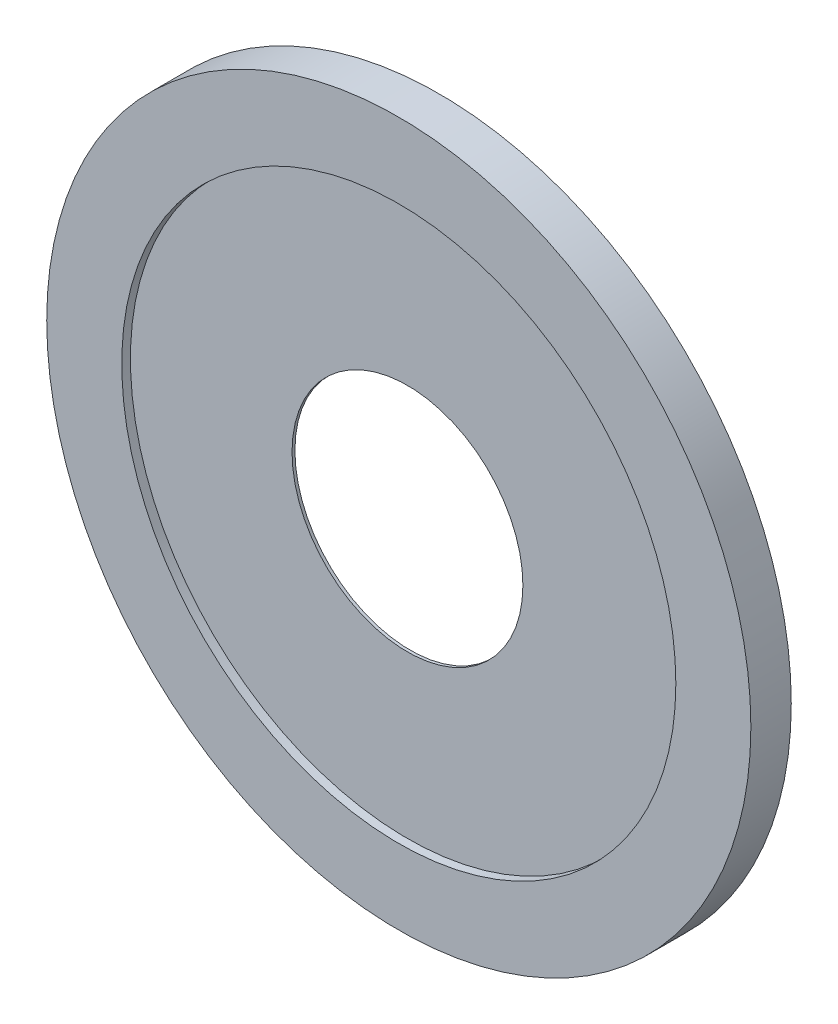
ISO-10303-21;
HEADER;
FILE_DESCRIPTION(('STEP AP214'),'2;1');
FILE_NAME('part.step','',(''),(''),'','','');
FILE_SCHEMA(('AUTOMOTIVE_DESIGN { 1 0 10303 214 1 1 1 1 }'));
ENDSEC;
DATA;
#1=APPLICATION_CONTEXT('core data for automotive mechanical design processes');
#2=APPLICATION_PROTOCOL_DEFINITION('international standard','automotive_design',2000,#1);
#3=PRODUCT_CONTEXT('',#1,'mechanical');
#4=PRODUCT('Part','Part','',(#3));
#5=PRODUCT_RELATED_PRODUCT_CATEGORY('part','',(#4));
#6=PRODUCT_DEFINITION_FORMATION('','',#4);
#7=PRODUCT_DEFINITION_CONTEXT('part definition',#1,'design');
#8=PRODUCT_DEFINITION('design','',#6,#7);
#9=PRODUCT_DEFINITION_SHAPE('','',#8);
#10=(LENGTH_UNIT() NAMED_UNIT(*) SI_UNIT(.MILLI.,.METRE.));
#11=(NAMED_UNIT(*) PLANE_ANGLE_UNIT() SI_UNIT($,.RADIAN.));
#12=(NAMED_UNIT(*) SI_UNIT($,.STERADIAN.) SOLID_ANGLE_UNIT());
#13=UNCERTAINTY_MEASURE_WITH_UNIT(LENGTH_MEASURE(1.E-05),#10,'distance_accuracy_value','');
#14=(GEOMETRIC_REPRESENTATION_CONTEXT(3) GLOBAL_UNCERTAINTY_ASSIGNED_CONTEXT((#13)) GLOBAL_UNIT_ASSIGNED_CONTEXT((#10,
#11,#12)) REPRESENTATION_CONTEXT('',''));
#15=CARTESIAN_POINT('',(0.,0.,0.));
#16=DIRECTION('',(0.,0.,1.));
#17=DIRECTION('',(1.,0.,0.));
#18=AXIS2_PLACEMENT_3D('',#15,#16,#17);
#19=CARTESIAN_POINT('',(0.,0.,44.45));
#20=DIRECTION('',(0.,0.,-1.));
#21=DIRECTION('',(-1.,0.,0.));
#22=AXIS2_PLACEMENT_3D('',#19,#20,#21);
#23=CYLINDRICAL_SURFACE('',#22,387.35);
#24=CARTESIAN_POINT('',(0.,0.,44.45));
#25=DIRECTION('',(0.,0.,1.));
#26=DIRECTION('',(1.,0.,0.));
#27=AXIS2_PLACEMENT_3D('',#24,#25,#26);
#28=CIRCLE('',#27,387.35);
#29=CARTESIAN_POINT('',(387.35,0.,44.45));
#30=VERTEX_POINT('',#29);
#31=EDGE_CURVE('E10',#30,#30,#28,.T.);
#32=ORIENTED_EDGE('',*,*,#31,.F.);
#33=EDGE_LOOP('',(#32));
#34=FACE_BOUND('',#33,.T.);
#35=CARTESIAN_POINT('',(0.,0.,0.));
#36=DIRECTION('',(0.,0.,1.));
#37=DIRECTION('',(1.,0.,0.));
#38=AXIS2_PLACEMENT_3D('',#35,#36,#37);
#39=CIRCLE('',#38,387.35);
#40=CARTESIAN_POINT('',(387.35,0.,0.));
#41=VERTEX_POINT('',#40);
#42=EDGE_CURVE('E36',#41,#41,#39,.T.);
#43=ORIENTED_EDGE('',*,*,#42,.T.);
#44=EDGE_LOOP('',(#43));
#45=FACE_BOUND('',#44,.T.);
#46=ADVANCED_FACE('F33',(#34,#45),#23,.T.);
#47=CARTESIAN_POINT('',(0.,0.,44.45));
#48=DIRECTION('',(0.,0.,1.));
#49=DIRECTION('',(1.,0.,0.));
#50=AXIS2_PLACEMENT_3D('',#47,#48,#49);
#51=PLANE('',#50);
#52=CARTESIAN_POINT('',(0.,0.,44.45));
#53=DIRECTION('',(0.,0.,1.));
#54=DIRECTION('',(1.,0.,0.));
#55=AXIS2_PLACEMENT_3D('',#52,#53,#54);
#56=CIRCLE('',#55,304.8);
#57=CARTESIAN_POINT('',(304.8,0.,44.45));
#58=VERTEX_POINT('',#57);
#59=EDGE_CURVE('E45',#58,#58,#56,.T.);
#60=ORIENTED_EDGE('',*,*,#59,.F.);
#61=EDGE_LOOP('',(#60));
#62=FACE_BOUND('',#61,.T.);
#63=ORIENTED_EDGE('',*,*,#31,.T.);
#64=EDGE_LOOP('',(#63));
#65=FACE_BOUND('',#64,.T.);
#66=ADVANCED_FACE('F79',(#62,#65),#51,.T.);
#67=CARTESIAN_POINT('',(0.,0.,0.));
#68=DIRECTION('',(0.,0.,1.));
#69=DIRECTION('',(1.,0.,0.));
#70=AXIS2_PLACEMENT_3D('',#67,#68,#69);
#71=PLANE('',#70);
#72=CARTESIAN_POINT('',(0.,0.,0.));
#73=DIRECTION('',(0.,0.,-1.));
#74=DIRECTION('',(-1.,0.,0.));
#75=AXIS2_PLACEMENT_3D('',#72,#73,#74);
#76=CIRCLE('',#75,304.8);
#77=CARTESIAN_POINT('',(-304.8,0.,0.));
#78=VERTEX_POINT('',#77);
#79=EDGE_CURVE('E51',#78,#78,#76,.T.);
#80=ORIENTED_EDGE('',*,*,#79,.F.);
#81=EDGE_LOOP('',(#80));
#82=FACE_BOUND('',#81,.T.);
#83=ORIENTED_EDGE('',*,*,#42,.F.);
#84=EDGE_LOOP('',(#83));
#85=FACE_BOUND('',#84,.T.);
#86=ADVANCED_FACE('F75',(#82,#85),#71,.F.);
#87=CARTESIAN_POINT('',(0.,0.,34.925));
#88=DIRECTION('',(0.,0.,1.));
#89=DIRECTION('',(1.,0.,0.));
#90=AXIS2_PLACEMENT_3D('',#87,#88,#89);
#91=CYLINDRICAL_SURFACE('',#90,304.8);
#92=CARTESIAN_POINT('',(0.,0.,34.925));
#93=DIRECTION('',(0.,0.,1.));
#94=DIRECTION('',(1.,0.,0.));
#95=AXIS2_PLACEMENT_3D('',#92,#93,#94);
#96=CIRCLE('',#95,304.8);
#97=CARTESIAN_POINT('',(304.8,0.,34.925));
#98=VERTEX_POINT('',#97);
#99=EDGE_CURVE('E43',#98,#98,#96,.T.);
#100=CARTESIAN_POINT('',(304.8,0.,34.925));
#101=CARTESIAN_POINT('',(304.8,0.,35.02421875));
#102=CARTESIAN_POINT('',(304.8,0.,35.1234375));
#103=CARTESIAN_POINT('',(304.8,0.,35.321875));
#104=CARTESIAN_POINT('',(304.8,0.,35.42109375));
#105=CARTESIAN_POINT('',(304.8,0.,35.61953125));
#106=CARTESIAN_POINT('',(304.8,0.,35.71875));
#107=CARTESIAN_POINT('',(304.8,0.,35.9171875));
#108=CARTESIAN_POINT('',(304.8,0.,36.01640625));
#109=CARTESIAN_POINT('',(304.8,0.,36.21484375));
#110=CARTESIAN_POINT('',(304.8,0.,36.3140625));
#111=CARTESIAN_POINT('',(304.8,0.,36.5125));
#112=CARTESIAN_POINT('',(304.8,0.,36.61171875));
#113=CARTESIAN_POINT('',(304.8,0.,36.81015625));
#114=CARTESIAN_POINT('',(304.8,0.,36.909375));
#115=CARTESIAN_POINT('',(304.8,0.,37.1078125));
#116=CARTESIAN_POINT('',(304.8,0.,37.20703125));
#117=CARTESIAN_POINT('',(304.8,0.,37.40546875));
#118=CARTESIAN_POINT('',(304.8,0.,37.5046875));
#119=CARTESIAN_POINT('',(304.8,0.,37.703125));
#120=CARTESIAN_POINT('',(304.8,0.,37.80234375));
#121=CARTESIAN_POINT('',(304.8,0.,38.00078125));
#122=CARTESIAN_POINT('',(304.8,0.,38.1));
#123=CARTESIAN_POINT('',(304.8,0.,38.2984375));
#124=CARTESIAN_POINT('',(304.8,0.,38.39765625));
#125=CARTESIAN_POINT('',(304.8,0.,38.59609375));
#126=CARTESIAN_POINT('',(304.8,0.,38.6953125));
#127=CARTESIAN_POINT('',(304.8,0.,38.89375));
#128=CARTESIAN_POINT('',(304.8,0.,38.99296875));
#129=CARTESIAN_POINT('',(304.8,0.,39.19140625));
#130=CARTESIAN_POINT('',(304.8,0.,39.290625));
#131=CARTESIAN_POINT('',(304.8,0.,39.4890625));
#132=CARTESIAN_POINT('',(304.8,0.,39.58828125));
#133=CARTESIAN_POINT('',(304.8,0.,39.78671875));
#134=CARTESIAN_POINT('',(304.8,0.,39.8859375));
#135=CARTESIAN_POINT('',(304.8,0.,40.084375));
#136=CARTESIAN_POINT('',(304.8,0.,40.18359375));
#137=CARTESIAN_POINT('',(304.8,0.,40.38203125));
#138=CARTESIAN_POINT('',(304.8,0.,40.48125));
#139=CARTESIAN_POINT('',(304.8,0.,40.6796875));
#140=CARTESIAN_POINT('',(304.8,0.,40.77890625));
#141=CARTESIAN_POINT('',(304.8,0.,40.97734375));
#142=CARTESIAN_POINT('',(304.8,0.,41.0765625));
#143=CARTESIAN_POINT('',(304.8,0.,41.275));
#144=CARTESIAN_POINT('',(304.8,0.,41.37421875));
#145=CARTESIAN_POINT('',(304.8,0.,41.57265625));
#146=CARTESIAN_POINT('',(304.8,0.,41.671875));
#147=CARTESIAN_POINT('',(304.8,0.,41.8703125));
#148=CARTESIAN_POINT('',(304.8,0.,41.96953125));
#149=CARTESIAN_POINT('',(304.8,0.,42.16796875));
#150=CARTESIAN_POINT('',(304.8,0.,42.2671875));
#151=CARTESIAN_POINT('',(304.8,0.,42.465625));
#152=CARTESIAN_POINT('',(304.8,0.,42.56484375));
#153=CARTESIAN_POINT('',(304.8,0.,42.76328125));
#154=CARTESIAN_POINT('',(304.8,0.,42.8625));
#155=CARTESIAN_POINT('',(304.8,0.,43.0609375));
#156=CARTESIAN_POINT('',(304.8,0.,43.16015625));
#157=CARTESIAN_POINT('',(304.8,0.,43.35859375));
#158=CARTESIAN_POINT('',(304.8,0.,43.4578125));
#159=CARTESIAN_POINT('',(304.8,0.,43.65625));
#160=CARTESIAN_POINT('',(304.8,0.,43.75546875));
#161=CARTESIAN_POINT('',(304.8,0.,43.95390625));
#162=CARTESIAN_POINT('',(304.8,0.,44.053125));
#163=CARTESIAN_POINT('',(304.8,0.,44.2515625));
#164=CARTESIAN_POINT('',(304.8,0.,44.35078125));
#165=CARTESIAN_POINT('',(304.8,0.,44.45));
#166=B_SPLINE_CURVE_WITH_KNOTS('',3,(#100,#101,#102,#103,#104,#105,#106,#107,#108,#109,#110,
#111,#112,#113,#114,#115,#116,#117,#118,#119,#120,#121,#122,#123,#124,#125,#126,#127,#128,#129,
#130,#131,#132,#133,#134,#135,#136,#137,#138,#139,#140,#141,#142,#143,#144,#145,#146,#147,#148,
#149,#150,#151,#152,#153,#154,#155,#156,#157,#158,#159,#160,#161,#162,#163,#164,#165),
.UNSPECIFIED.,.F.,.F.,(4,2,2,2,2,2,2,2,2,2,2,2,2,2,2,2,2,2,2,2,2,2,2,2,2,2,2,2,2,2,2,2,4),(0.,
0.297656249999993,0.595312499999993,0.892968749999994,1.19062499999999,1.48828124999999,
1.78593749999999,2.08359374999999,2.38124999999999,2.67890624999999,2.97656249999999,
3.27421874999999,3.571875,3.86953125,4.1671875,4.46484375,4.7625,5.06015625,5.3578125,
5.65546875,5.953125,6.25078125,6.5484375,6.84609375,7.14375,7.44140625,7.7390625,8.03671875,
8.334375,8.63203125,8.9296875,9.22734375,9.525),.UNSPECIFIED.);
#167=EDGE_CURVE('BSEAM69',#98,#58,#166,.T.);
#168=ORIENTED_EDGE('',*,*,#99,.F.);
#169=ORIENTED_EDGE('',*,*,#59,.T.);
#170=ORIENTED_EDGE('',*,*,#167,.T.);
#171=ORIENTED_EDGE('',*,*,#167,.F.);
#172=EDGE_LOOP('',(#168,#170,#169,#171));
#173=FACE_BOUND('',#172,.T.);
#174=ADVANCED_FACE('F69',(#173),#91,.F.);
#175=CARTESIAN_POINT('',(0.,0.,34.925));
#176=DIRECTION('',(0.,0.,1.));
#177=DIRECTION('',(1.,0.,0.));
#178=AXIS2_PLACEMENT_3D('',#175,#176,#177);
#179=PLANE('',#178);
#180=CARTESIAN_POINT('',(0.,0.,34.925));
#181=DIRECTION('',(0.,0.,1.));
#182=DIRECTION('',(1.,0.,0.));
#183=AXIS2_PLACEMENT_3D('',#180,#181,#182);
#184=CIRCLE('',#183,127.);
#185=CARTESIAN_POINT('',(127.,0.,34.925));
#186=VERTEX_POINT('',#185);
#187=EDGE_CURVE('E54',#186,#186,#184,.T.);
#188=ORIENTED_EDGE('',*,*,#187,.F.);
#189=EDGE_LOOP('',(#188));
#190=FACE_BOUND('',#189,.T.);
#191=ORIENTED_EDGE('',*,*,#99,.T.);
#192=EDGE_LOOP('',(#191));
#193=FACE_BOUND('',#192,.T.);
#194=ADVANCED_FACE('F65',(#190,#193),#179,.T.);
#195=CARTESIAN_POINT('',(0.,0.,31.75));
#196=DIRECTION('',(0.,0.,-1.));
#197=DIRECTION('',(-1.,0.,0.));
#198=AXIS2_PLACEMENT_3D('',#195,#196,#197);
#199=CYLINDRICAL_SURFACE('',#198,304.8);
#200=CARTESIAN_POINT('',(0.,0.,31.75));
#201=DIRECTION('',(0.,0.,-1.));
#202=DIRECTION('',(-1.,0.,0.));
#203=AXIS2_PLACEMENT_3D('',#200,#201,#202);
#204=CIRCLE('',#203,304.8);
#205=CARTESIAN_POINT('',(-304.8,0.,31.75));
#206=VERTEX_POINT('',#205);
#207=EDGE_CURVE('E48',#206,#206,#204,.T.);
#208=ORIENTED_EDGE('',*,*,#207,.F.);
#209=EDGE_LOOP('',(#208));
#210=FACE_BOUND('',#209,.T.);
#211=ORIENTED_EDGE('',*,*,#79,.T.);
#212=EDGE_LOOP('',(#211));
#213=FACE_BOUND('',#212,.T.);
#214=ADVANCED_FACE('F68',(#210,#213),#199,.F.);
#215=CARTESIAN_POINT('',(0.,0.,31.75));
#216=DIRECTION('',(0.,0.,-1.));
#217=DIRECTION('',(-1.,0.,0.));
#218=AXIS2_PLACEMENT_3D('',#215,#216,#217);
#219=PLANE('',#218);
#220=CARTESIAN_POINT('',(0.,0.,31.75));
#221=DIRECTION('',(0.,0.,-1.));
#222=DIRECTION('',(-1.,0.,0.));
#223=AXIS2_PLACEMENT_3D('',#220,#221,#222);
#224=CIRCLE('',#223,127.);
#225=CARTESIAN_POINT('',(-127.,0.,31.75));
#226=VERTEX_POINT('',#225);
#227=EDGE_CURVE('E57',#226,#226,#224,.F.);
#228=ORIENTED_EDGE('',*,*,#227,.T.);
#229=EDGE_LOOP('',(#228));
#230=FACE_BOUND('',#229,.T.);
#231=ORIENTED_EDGE('',*,*,#207,.T.);
#232=EDGE_LOOP('',(#231));
#233=FACE_BOUND('',#232,.T.);
#234=ADVANCED_FACE('F91',(#230,#233),#219,.T.);
#235=CARTESIAN_POINT('',(0.,0.,-0.001000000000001));
#236=DIRECTION('',(0.,0.,1.));
#237=DIRECTION('',(1.,0.,0.));
#238=AXIS2_PLACEMENT_3D('',#235,#236,#237);
#239=CYLINDRICAL_SURFACE('',#238,127.);
#240=ORIENTED_EDGE('',*,*,#227,.F.);
#241=EDGE_LOOP('',(#240));
#242=FACE_BOUND('',#241,.T.);
#243=ORIENTED_EDGE('',*,*,#187,.T.);
#244=EDGE_LOOP('',(#243));
#245=FACE_BOUND('',#244,.T.);
#246=ADVANCED_FACE('F63',(#242,#245),#239,.F.);
#247=CLOSED_SHELL('',(#46,#66,#86,#174,#194,#214,#234,#246));
#248=MANIFOLD_SOLID_BREP('B2',#247);
#249=ADVANCED_BREP_SHAPE_REPRESENTATION('',(#18,#248),#14);
#250=SHAPE_DEFINITION_REPRESENTATION(#9,#249);
ENDSEC;
END-ISO-10303-21;
